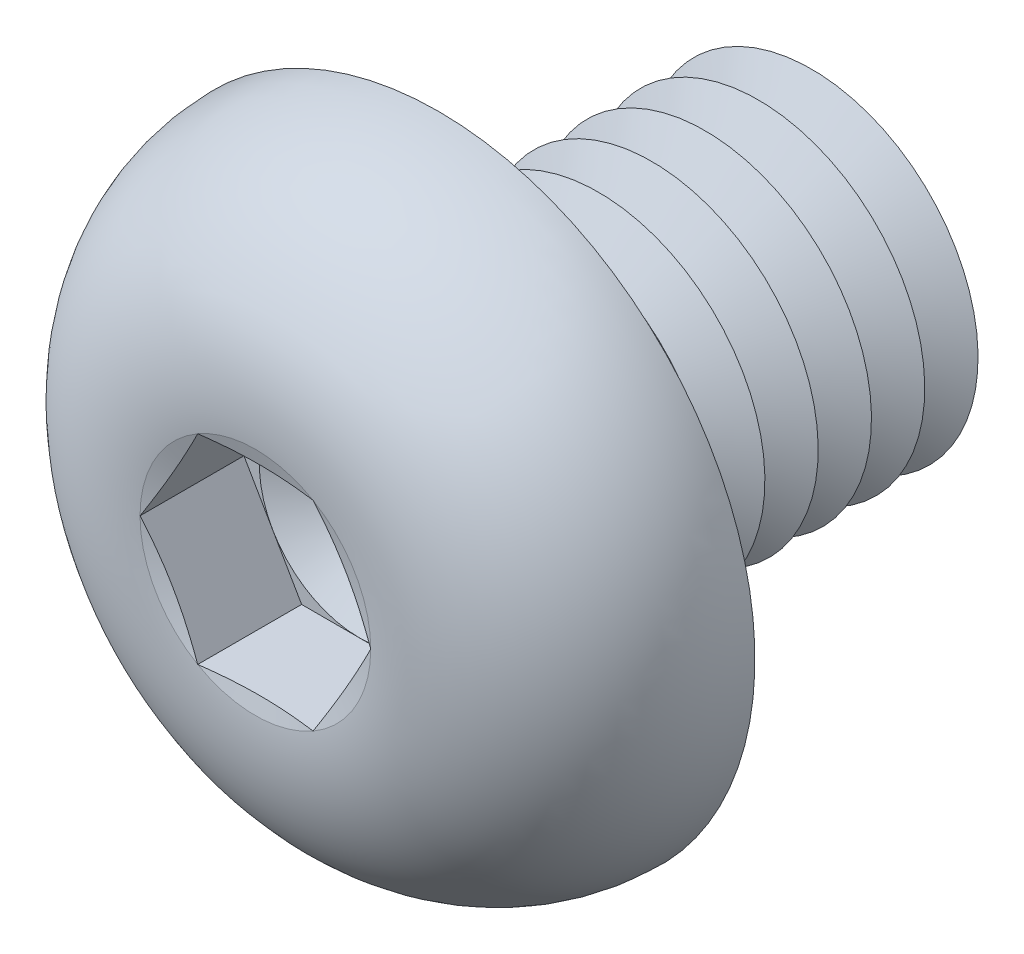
ISO-10303-21;
HEADER;
FILE_DESCRIPTION(('STEP AP214'),'2;1');
FILE_NAME('part.step','',(''),(''),'','','');
FILE_SCHEMA(('AUTOMOTIVE_DESIGN { 1 0 10303 214 1 1 1 1 }'));
ENDSEC;
DATA;
#1=APPLICATION_CONTEXT('core data for automotive mechanical design processes');
#2=APPLICATION_PROTOCOL_DEFINITION('international standard','automotive_design',2000,#1);
#3=PRODUCT_CONTEXT('',#1,'mechanical');
#4=PRODUCT('Part','Part','',(#3));
#5=PRODUCT_RELATED_PRODUCT_CATEGORY('part','',(#4));
#6=PRODUCT_DEFINITION_FORMATION('','',#4);
#7=PRODUCT_DEFINITION_CONTEXT('part definition',#1,'design');
#8=PRODUCT_DEFINITION('design','',#6,#7);
#9=PRODUCT_DEFINITION_SHAPE('','',#8);
#10=(LENGTH_UNIT() NAMED_UNIT(*) SI_UNIT(.MILLI.,.METRE.));
#11=(NAMED_UNIT(*) PLANE_ANGLE_UNIT() SI_UNIT($,.RADIAN.));
#12=(NAMED_UNIT(*) SI_UNIT($,.STERADIAN.) SOLID_ANGLE_UNIT());
#13=UNCERTAINTY_MEASURE_WITH_UNIT(LENGTH_MEASURE(1.E-05),#10,'distance_accuracy_value','');
#14=(GEOMETRIC_REPRESENTATION_CONTEXT(3) GLOBAL_UNCERTAINTY_ASSIGNED_CONTEXT((#13)) GLOBAL_UNIT_ASSIGNED_CONTEXT((#10,
#11,#12)) REPRESENTATION_CONTEXT('',''));
#15=CARTESIAN_POINT('',(0.,0.,0.));
#16=DIRECTION('',(0.,0.,1.));
#17=DIRECTION('',(1.,0.,0.));
#18=AXIS2_PLACEMENT_3D('',#15,#16,#17);
#19=CARTESIAN_POINT('',(0.,0.,1.19));
#20=DIRECTION('',(0.,0.,1.));
#21=DIRECTION('',(1.,0.,0.));
#22=AXIS2_PLACEMENT_3D('',#19,#20,#21);
#23=PLANE('',#22);
#24=CARTESIAN_POINT('',(0.,0.,1.19));
#25=DIRECTION('',(0.,0.,1.));
#26=DIRECTION('',(1.,0.,0.));
#27=AXIS2_PLACEMENT_3D('',#24,#25,#26);
#28=CIRCLE('',#27,1.49999930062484);
#29=CARTESIAN_POINT('',(1.2990375,0.749999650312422,1.19));
#30=VERTEX_POINT('',#29);
#31=CARTESIAN_POINT('',(0.,1.49999930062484,1.19));
#32=VERTEX_POINT('',#31);
#33=EDGE_CURVE('E118',#30,#32,#28,.T.);
#34=ORIENTED_EDGE('',*,*,#33,.F.);
#35=DIRECTION('',(-0.5,0.866025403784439,0.));
#36=VECTOR('',#35,1.);
#37=CARTESIAN_POINT('',(1.73205000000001,0.,1.19));
#38=LINE('',#37,#36);
#39=CARTESIAN_POINT('',(0.866025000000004,1.49999930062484,1.19));
#40=VERTEX_POINT('',#39);
#41=EDGE_CURVE('E125',#30,#40,#38,.T.);
#42=ORIENTED_EDGE('',*,*,#41,.T.);
#43=DIRECTION('',(-1.,0.,0.));
#44=VECTOR('',#43,1.);
#45=CARTESIAN_POINT('',(0.866025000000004,1.49999930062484,1.19));
#46=LINE('',#45,#44);
#47=EDGE_CURVE('E136',#40,#32,#46,.T.);
#48=ORIENTED_EDGE('',*,*,#47,.T.);
#49=EDGE_LOOP('',(#34,#42,#48));
#50=FACE_BOUND('',#49,.T.);
#51=ADVANCED_FACE('F39',(#50),#23,.T.);
#52=CARTESIAN_POINT('',(0.,0.,1.19));
#53=DIRECTION('',(0.,0.,1.));
#54=DIRECTION('',(1.,0.,0.));
#55=AXIS2_PLACEMENT_3D('',#52,#53,#54);
#56=CIRCLE('',#55,1.49999930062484);
#57=CARTESIAN_POINT('',(-1.2990375,0.749999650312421,1.19));
#58=VERTEX_POINT('',#57);
#59=EDGE_CURVE('E11',#32,#58,#56,.T.);
#60=ORIENTED_EDGE('',*,*,#59,.F.);
#61=CARTESIAN_POINT('',(-0.866025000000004,1.49999930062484,1.19));
#62=VERTEX_POINT('',#61);
#63=EDGE_CURVE('E131',#32,#62,#46,.T.);
#64=ORIENTED_EDGE('',*,*,#63,.T.);
#65=DIRECTION('',(-0.5,-0.866025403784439,0.));
#66=VECTOR('',#65,1.);
#67=CARTESIAN_POINT('',(-0.866025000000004,1.49999930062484,1.19));
#68=LINE('',#67,#66);
#69=EDGE_CURVE('E134',#62,#58,#68,.T.);
#70=ORIENTED_EDGE('',*,*,#69,.T.);
#71=EDGE_LOOP('',(#60,#64,#70));
#72=FACE_BOUND('',#71,.T.);
#73=ADVANCED_FACE('F130',(#72),#23,.T.);
#74=CARTESIAN_POINT('',(-1.2990375,-0.749999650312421,1.19));
#75=VERTEX_POINT('',#74);
#76=EDGE_CURVE('E49',#58,#75,#56,.T.);
#77=ORIENTED_EDGE('',*,*,#76,.F.);
#78=CARTESIAN_POINT('',(-1.73205000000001,0.,1.19));
#79=VERTEX_POINT('',#78);
#80=EDGE_CURVE('E143',#58,#79,#68,.T.);
#81=ORIENTED_EDGE('',*,*,#80,.T.);
#82=DIRECTION('',(0.5,-0.866025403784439,0.));
#83=VECTOR('',#82,1.);
#84=CARTESIAN_POINT('',(-1.73205000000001,0.,1.19));
#85=LINE('',#84,#83);
#86=EDGE_CURVE('E152',#79,#75,#85,.T.);
#87=ORIENTED_EDGE('',*,*,#86,.T.);
#88=EDGE_LOOP('',(#77,#81,#87));
#89=FACE_BOUND('',#88,.T.);
#90=ADVANCED_FACE('F327',(#89),#23,.T.);
#91=CARTESIAN_POINT('',(0.,-1.49999930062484,1.19));
#92=VERTEX_POINT('',#91);
#93=EDGE_CURVE('E311',#75,#92,#56,.T.);
#94=ORIENTED_EDGE('',*,*,#93,.F.);
#95=CARTESIAN_POINT('',(-0.866025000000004,-1.49999930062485,1.19));
#96=VERTEX_POINT('',#95);
#97=EDGE_CURVE('E151',#75,#96,#85,.T.);
#98=ORIENTED_EDGE('',*,*,#97,.T.);
#99=DIRECTION('',(1.,0.,0.));
#100=VECTOR('',#99,1.);
#101=CARTESIAN_POINT('',(-0.866025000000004,-1.49999930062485,1.19));
#102=LINE('',#101,#100);
#103=EDGE_CURVE('E157',#96,#92,#102,.T.);
#104=ORIENTED_EDGE('',*,*,#103,.T.);
#105=EDGE_LOOP('',(#94,#98,#104));
#106=FACE_BOUND('',#105,.T.);
#107=ADVANCED_FACE('F321',(#106),#23,.T.);
#108=CARTESIAN_POINT('',(1.29903750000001,-0.749999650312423,1.19));
#109=VERTEX_POINT('',#108);
#110=EDGE_CURVE('E56',#92,#109,#56,.T.);
#111=ORIENTED_EDGE('',*,*,#110,.F.);
#112=CARTESIAN_POINT('',(0.866025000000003,-1.49999930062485,1.19));
#113=VERTEX_POINT('',#112);
#114=EDGE_CURVE('E156',#92,#113,#102,.T.);
#115=ORIENTED_EDGE('',*,*,#114,.T.);
#116=DIRECTION('',(0.5,0.866025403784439,0.));
#117=VECTOR('',#116,1.);
#118=CARTESIAN_POINT('',(0.866025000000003,-1.49999930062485,1.19));
#119=LINE('',#118,#117);
#120=EDGE_CURVE('E162',#113,#109,#119,.T.);
#121=ORIENTED_EDGE('',*,*,#120,.T.);
#122=EDGE_LOOP('',(#111,#115,#121));
#123=FACE_BOUND('',#122,.T.);
#124=ADVANCED_FACE('F397',(#123),#23,.T.);
#125=CARTESIAN_POINT('',(0.,0.,2.75));
#126=DIRECTION('',(0.,0.,1.));
#127=DIRECTION('',(0.,-1.,0.));
#128=AXIS2_PLACEMENT_3D('',#125,#126,#127);
#129=CONICAL_SURFACE('',#128,1.73205000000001,1.30899693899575);
#130=CARTESIAN_POINT('',(1.73216547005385,-0.000200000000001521,2.75003094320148));
#131=CARTESIAN_POINT('',(1.69619207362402,0.06210775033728,2.74038633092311));
#132=CARTESIAN_POINT('',(1.66015343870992,0.124528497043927,2.73163050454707));
#133=CARTESIAN_POINT('',(1.58794885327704,0.249590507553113,2.71624720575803));
#134=CARTESIAN_POINT('',(1.55178285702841,0.312231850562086,2.70962059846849));
#135=CARTESIAN_POINT('',(1.47954289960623,0.437355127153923,2.69888271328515));
#136=CARTESIAN_POINT('',(1.4434694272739,0.499836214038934,2.69475862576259));
#137=CARTESIAN_POINT('',(1.37127646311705,0.624878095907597,2.68922863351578));
#138=CARTESIAN_POINT('',(1.33515698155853,0.687438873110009,2.68782220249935));
#139=CARTESIAN_POINT('',(1.26291801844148,0.812560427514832,2.68782220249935));
#140=CARTESIAN_POINT('',(1.22679853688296,0.875121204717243,2.68922863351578));
#141=CARTESIAN_POINT('',(1.15460557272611,1.00016308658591,2.69475862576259));
#142=CARTESIAN_POINT('',(1.11853210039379,1.06264417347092,2.69888271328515));
#143=CARTESIAN_POINT('',(1.0462921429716,1.18776745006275,2.70962059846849));
#144=CARTESIAN_POINT('',(1.01012614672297,1.25040879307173,2.71624720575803));
#145=CARTESIAN_POINT('',(0.937921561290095,1.37547080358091,2.73163050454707));
#146=CARTESIAN_POINT('',(0.901882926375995,1.43789155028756,2.74038633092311));
#147=CARTESIAN_POINT('',(0.865909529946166,1.50019930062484,2.75003094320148));
#148=B_SPLINE_CURVE_WITH_KNOTS('',3,(#130,#131,#132,#133,#134,#135,#136,#137,#138,#139,#140,
#141,#142,#143,#144,#145,#146,#147),.UNSPECIFIED.,.F.,.F.,(4,2,2,2,2,2,2,2,4),(0.,
0.217782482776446,0.435653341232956,0.652399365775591,0.869103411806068,1.08580745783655,
1.30255348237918,1.52042434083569,1.73820682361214),.UNSPECIFIED.);
#149=CARTESIAN_POINT('',(1.73205000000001,0.,2.75));
#150=VERTEX_POINT('',#149);
#151=CARTESIAN_POINT('',(0.866025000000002,1.49999930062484,2.75));
#152=VERTEX_POINT('',#151);
#153=EDGE_CURVE('E221',#150,#152,#148,.T.);
#154=ORIENTED_EDGE('',*,*,#153,.F.);
#155=CARTESIAN_POINT('',(0.,0.,2.75));
#156=DIRECTION('',(0.,0.,-1.));
#157=DIRECTION('',(0.,1.,0.));
#158=AXIS2_PLACEMENT_3D('',#155,#156,#157);
#159=CIRCLE('',#158,1.73205000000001);
#160=EDGE_CURVE('E293',#152,#150,#159,.T.);
#161=ORIENTED_EDGE('',*,*,#160,.F.);
#162=EDGE_LOOP('',(#154,#161));
#163=FACE_BOUND('',#162,.T.);
#164=ADVANCED_FACE('F401',(#163),#129,.F.);
#165=CARTESIAN_POINT('',(0.865909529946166,-1.50019930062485,2.75003094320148));
#166=CARTESIAN_POINT('',(0.901882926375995,-1.43789155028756,2.7403863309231));
#167=CARTESIAN_POINT('',(0.937921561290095,-1.37547080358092,2.73163050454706));
#168=CARTESIAN_POINT('',(1.01012614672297,-1.25040879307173,2.71624720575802));
#169=CARTESIAN_POINT('',(1.0462921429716,-1.18776745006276,2.70962059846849));
#170=CARTESIAN_POINT('',(1.11853210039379,-1.06264417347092,2.69888271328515));
#171=CARTESIAN_POINT('',(1.15460557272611,-1.00016308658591,2.69475862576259));
#172=CARTESIAN_POINT('',(1.22679853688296,-0.875121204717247,2.68922863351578));
#173=CARTESIAN_POINT('',(1.26291801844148,-0.812560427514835,2.68782220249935));
#174=CARTESIAN_POINT('',(1.33515698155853,-0.687438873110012,2.68782220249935));
#175=CARTESIAN_POINT('',(1.37127646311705,-0.6248780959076,2.68922863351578));
#176=CARTESIAN_POINT('',(1.4434694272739,-0.499836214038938,2.69475862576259));
#177=CARTESIAN_POINT('',(1.47954289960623,-0.437355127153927,2.69888271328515));
#178=CARTESIAN_POINT('',(1.55178285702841,-0.312231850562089,2.70962059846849));
#179=CARTESIAN_POINT('',(1.58794885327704,-0.249590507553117,2.71624720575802));
#180=CARTESIAN_POINT('',(1.66015343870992,-0.12452849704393,2.73163050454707));
#181=CARTESIAN_POINT('',(1.69619207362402,-0.0621077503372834,2.74038633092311));
#182=CARTESIAN_POINT('',(1.73216547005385,0.000199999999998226,2.75003094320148));
#183=B_SPLINE_CURVE_WITH_KNOTS('',3,(#165,#166,#167,#168,#169,#170,#171,#172,#173,#174,#175,
#176,#177,#178,#179,#180,#181,#182),.UNSPECIFIED.,.F.,.F.,(4,2,2,2,2,2,2,2,4),(0.,
0.217782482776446,0.435653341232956,0.65239936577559,0.869103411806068,1.08580745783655,
1.30255348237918,1.52042434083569,1.73820682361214),.UNSPECIFIED.);
#184=CARTESIAN_POINT('',(0.866025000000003,-1.49999930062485,2.75));
#185=VERTEX_POINT('',#184);
#186=EDGE_CURVE('E230',#185,#150,#183,.T.);
#187=ORIENTED_EDGE('',*,*,#186,.F.);
#188=EDGE_CURVE('E298',#150,#185,#159,.T.);
#189=ORIENTED_EDGE('',*,*,#188,.F.);
#190=EDGE_LOOP('',(#187,#189));
#191=FACE_BOUND('',#190,.T.);
#192=ADVANCED_FACE('F362',(#191),#129,.F.);
#193=CARTESIAN_POINT('',(-2.61375031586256,-1.49999930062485,3.09338600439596));
#194=CARTESIAN_POINT('',(-2.4871989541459,-1.49999930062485,3.06401688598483));
#195=CARTESIAN_POINT('',(-2.36054180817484,-1.49999930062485,3.03507426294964));
#196=CARTESIAN_POINT('',(-2.10688190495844,-1.49999930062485,2.97862489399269));
#197=CARTESIAN_POINT('',(-1.97987908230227,-1.49999930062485,2.95111844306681));
#198=CARTESIAN_POINT('',(-1.72425281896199,-1.49999930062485,2.89788845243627));
#199=CARTESIAN_POINT('',(-1.59562534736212,-1.49999930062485,2.87218404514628));
#200=CARTESIAN_POINT('',(-1.33776732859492,-1.49999930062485,2.82387586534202));
#201=CARTESIAN_POINT('',(-1.20853672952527,-1.49999930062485,2.80127236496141));
#202=CARTESIAN_POINT('',(-0.952831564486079,-1.49999930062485,2.76126658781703));
#203=CARTESIAN_POINT('',(-0.826376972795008,-1.49999930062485,2.74374018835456));
#204=CARTESIAN_POINT('',(-0.572755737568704,-1.49999930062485,2.71502809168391));
#205=CARTESIAN_POINT('',(-0.445589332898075,-1.49999930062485,2.70384038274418));
#206=CARTESIAN_POINT('',(-0.191333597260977,-1.49999930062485,2.68972083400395));
#207=CARTESIAN_POINT('',(-0.0642464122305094,-1.49999930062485,2.68675270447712));
#208=CARTESIAN_POINT('',(0.189835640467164,-1.49999930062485,2.68959577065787));
#209=CARTESIAN_POINT('',(0.316830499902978,-1.49999930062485,2.69540767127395));
#210=CARTESIAN_POINT('',(0.534182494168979,-1.49999930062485,2.71190493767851));
#211=CARTESIAN_POINT('',(0.624691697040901,-1.49999930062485,2.72073513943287));
#212=CARTESIAN_POINT('',(0.805336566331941,-1.49999930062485,2.74156379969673));
#213=CARTESIAN_POINT('',(0.895472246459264,-1.49999930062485,2.75356214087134));
#214=CARTESIAN_POINT('',(1.0756572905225,-1.49999930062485,2.78006977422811));
#215=CARTESIAN_POINT('',(1.16570548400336,-1.49999930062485,2.7945868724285));
#216=CARTESIAN_POINT('',(1.3454787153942,-1.49999930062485,2.82550612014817));
#217=CARTESIAN_POINT('',(1.43520373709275,-1.49999930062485,2.8419083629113));
#218=CARTESIAN_POINT('',(1.61622412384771,-1.49999930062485,2.87648604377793));
#219=CARTESIAN_POINT('',(1.7075137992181,-1.49999930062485,2.89469103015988));
#220=CARTESIAN_POINT('',(1.88986344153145,-1.49999930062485,2.93221618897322));
#221=CARTESIAN_POINT('',(1.9809234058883,-1.49999930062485,2.95153637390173));
#222=CARTESIAN_POINT('',(2.1623635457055,-1.49999930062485,2.99091506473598));
#223=CARTESIAN_POINT('',(2.25274472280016,-1.49999930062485,3.01096897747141));
#224=CARTESIAN_POINT('',(2.43335289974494,-1.49999930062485,3.05173139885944));
#225=CARTESIAN_POINT('',(2.52357990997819,-1.49999930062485,3.07243986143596));
#226=CARTESIAN_POINT('',(2.61375031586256,-1.49999930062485,3.09338600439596));
#227=B_SPLINE_CURVE_WITH_KNOTS('',3,(#193,#194,#195,#196,#197,#198,#199,#200,#201,#202,#203,
#204,#205,#206,#207,#208,#209,#210,#211,#212,#213,#214,#215,#216,#217,#218,#219,#220,#221,#222,
#223,#224,#225,#226),.UNSPECIFIED.,.F.,.F.,(4,2,2,2,2,2,2,2,2,2,2,2,2,2,2,2,4),(0.,
0.389753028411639,0.779585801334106,1.17307326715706,1.56659524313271,1.94947555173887,
2.33223427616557,2.71330039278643,3.09439710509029,3.36715350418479,3.63989980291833,
3.91350699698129,4.18712773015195,4.46638029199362,4.74563598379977,5.02337106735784,
5.30108664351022),.UNSPECIFIED.);
#228=CARTESIAN_POINT('',(-0.866025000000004,-1.49999930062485,2.75));
#229=VERTEX_POINT('',#228);
#230=EDGE_CURVE('E341',#229,#185,#227,.T.);
#231=ORIENTED_EDGE('',*,*,#230,.F.);
#232=EDGE_CURVE('E354',#185,#229,#159,.T.);
#233=ORIENTED_EDGE('',*,*,#232,.F.);
#234=EDGE_LOOP('',(#231,#233));
#235=FACE_BOUND('',#234,.T.);
#236=ADVANCED_FACE('F368',(#235),#129,.F.);
#237=CARTESIAN_POINT('',(-1.73216547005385,0.000199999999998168,2.75003094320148));
#238=CARTESIAN_POINT('',(-1.69619207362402,-0.0621077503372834,2.74038633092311));
#239=CARTESIAN_POINT('',(-1.66015343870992,-0.12452849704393,2.73163050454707));
#240=CARTESIAN_POINT('',(-1.58794885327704,-0.249590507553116,2.71624720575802));
#241=CARTESIAN_POINT('',(-1.55178285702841,-0.312231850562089,2.70962059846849));
#242=CARTESIAN_POINT('',(-1.47954289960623,-0.437355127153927,2.69888271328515));
#243=CARTESIAN_POINT('',(-1.4434694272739,-0.499836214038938,2.69475862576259));
#244=CARTESIAN_POINT('',(-1.37127646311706,-0.624878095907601,2.68922863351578));
#245=CARTESIAN_POINT('',(-1.33515698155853,-0.687438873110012,2.68782220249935));
#246=CARTESIAN_POINT('',(-1.26291801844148,-0.812560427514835,2.68782220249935));
#247=CARTESIAN_POINT('',(-1.22679853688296,-0.875121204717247,2.68922863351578));
#248=CARTESIAN_POINT('',(-1.15460557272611,-1.00016308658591,2.69475862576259));
#249=CARTESIAN_POINT('',(-1.11853210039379,-1.06264417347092,2.69888271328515));
#250=CARTESIAN_POINT('',(-1.0462921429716,-1.18776745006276,2.70962059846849));
#251=CARTESIAN_POINT('',(-1.01012614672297,-1.25040879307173,2.71624720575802));
#252=CARTESIAN_POINT('',(-0.937921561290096,-1.37547080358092,2.73163050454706));
#253=CARTESIAN_POINT('',(-0.901882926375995,-1.43789155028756,2.74038633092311));
#254=CARTESIAN_POINT('',(-0.865909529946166,-1.50019930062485,2.75003094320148));
#255=B_SPLINE_CURVE_WITH_KNOTS('',3,(#237,#238,#239,#240,#241,#242,#243,#244,#245,#246,#247,
#248,#249,#250,#251,#252,#253,#254),.UNSPECIFIED.,.F.,.F.,(4,2,2,2,2,2,2,2,4),(0.,
0.217782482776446,0.435653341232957,0.652399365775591,0.869103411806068,1.08580745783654,
1.30255348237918,1.52042434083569,1.73820682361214),.UNSPECIFIED.);
#256=CARTESIAN_POINT('',(-1.73205000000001,0.,2.75));
#257=VERTEX_POINT('',#256);
#258=EDGE_CURVE('E332',#257,#229,#255,.T.);
#259=ORIENTED_EDGE('',*,*,#258,.F.);
#260=EDGE_CURVE('E338',#229,#257,#159,.T.);
#261=ORIENTED_EDGE('',*,*,#260,.F.);
#262=EDGE_LOOP('',(#259,#261));
#263=FACE_BOUND('',#262,.T.);
#264=ADVANCED_FACE('F336',(#263),#129,.F.);
#265=CARTESIAN_POINT('',(-0.865909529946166,1.50019930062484,2.75003094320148));
#266=CARTESIAN_POINT('',(-0.901882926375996,1.43789155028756,2.74038633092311));
#267=CARTESIAN_POINT('',(-0.937921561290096,1.37547080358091,2.73163050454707));
#268=CARTESIAN_POINT('',(-1.01012614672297,1.25040879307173,2.71624720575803));
#269=CARTESIAN_POINT('',(-1.0462921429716,1.18776745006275,2.70962059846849));
#270=CARTESIAN_POINT('',(-1.11853210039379,1.06264417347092,2.69888271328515));
#271=CARTESIAN_POINT('',(-1.15460557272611,1.00016308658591,2.69475862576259));
#272=CARTESIAN_POINT('',(-1.22679853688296,0.875121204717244,2.68922863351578));
#273=CARTESIAN_POINT('',(-1.26291801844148,0.812560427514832,2.68782220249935));
#274=CARTESIAN_POINT('',(-1.33515698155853,0.687438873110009,2.68782220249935));
#275=CARTESIAN_POINT('',(-1.37127646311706,0.624878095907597,2.68922863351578));
#276=CARTESIAN_POINT('',(-1.4434694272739,0.499836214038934,2.69475862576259));
#277=CARTESIAN_POINT('',(-1.47954289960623,0.437355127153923,2.69888271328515));
#278=CARTESIAN_POINT('',(-1.55178285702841,0.312231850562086,2.70962059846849));
#279=CARTESIAN_POINT('',(-1.58794885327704,0.249590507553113,2.71624720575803));
#280=CARTESIAN_POINT('',(-1.66015343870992,0.124528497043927,2.73163050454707));
#281=CARTESIAN_POINT('',(-1.69619207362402,0.0621077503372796,2.74038633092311));
#282=CARTESIAN_POINT('',(-1.73216547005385,-0.000200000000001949,2.75003094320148));
#283=B_SPLINE_CURVE_WITH_KNOTS('',3,(#265,#266,#267,#268,#269,#270,#271,#272,#273,#274,#275,
#276,#277,#278,#279,#280,#281,#282),.UNSPECIFIED.,.F.,.F.,(4,2,2,2,2,2,2,2,4),(0.,
0.217782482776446,0.435653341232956,0.65239936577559,0.869103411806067,1.08580745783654,
1.30255348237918,1.52042434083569,1.73820682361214),.UNSPECIFIED.);
#284=CARTESIAN_POINT('',(-0.866025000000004,1.49999930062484,2.75));
#285=VERTEX_POINT('',#284);
#286=EDGE_CURVE('E194',#285,#257,#283,.T.);
#287=ORIENTED_EDGE('',*,*,#286,.F.);
#288=EDGE_CURVE('E344',#257,#285,#159,.T.);
#289=ORIENTED_EDGE('',*,*,#288,.F.);
#290=EDGE_LOOP('',(#287,#289));
#291=FACE_BOUND('',#290,.T.);
#292=ADVANCED_FACE('F345',(#291),#129,.F.);
#293=CARTESIAN_POINT('',(0.,0.,-3.2));
#294=DIRECTION('',(0.,0.,1.));
#295=DIRECTION('',(0.,-1.,0.));
#296=AXIS2_PLACEMENT_3D('',#293,#294,#295);
#297=CONICAL_SURFACE('',#296,2.49999999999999,1.0471975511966);
#298=CARTESIAN_POINT('',(0.,0.,-3.6));
#299=DIRECTION('',(0.,0.,1.));
#300=DIRECTION('',(0.,-1.,0.));
#301=AXIS2_PLACEMENT_3D('',#298,#299,#300);
#302=CIRCLE('',#301,1.80717967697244);
#303=CARTESIAN_POINT('',(0.,-1.80717967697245,-3.6));
#304=VERTEX_POINT('',#303);
#305=EDGE_CURVE('E264',#304,#304,#302,.T.);
#306=ORIENTED_EDGE('',*,*,#305,.T.);
#307=EDGE_LOOP('',(#306));
#308=FACE_BOUND('',#307,.T.);
#309=CARTESIAN_POINT('',(0.,0.,-3.2));
#310=DIRECTION('',(0.,0.,1.));
#311=DIRECTION('',(0.,-1.,0.));
#312=AXIS2_PLACEMENT_3D('',#309,#310,#311);
#313=CIRCLE('',#312,2.49999999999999);
#314=CARTESIAN_POINT('',(0.,-2.5,-3.20000000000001));
#315=VERTEX_POINT('',#314);
#316=EDGE_CURVE('E260',#315,#315,#313,.T.);
#317=ORIENTED_EDGE('',*,*,#316,.F.);
#318=EDGE_LOOP('',(#317));
#319=FACE_BOUND('',#318,.T.);
#320=ADVANCED_FACE('F429',(#308,#319),#297,.T.);
#321=CARTESIAN_POINT('',(0.,0.,-3.6));
#322=DIRECTION('',(0.,0.,-1.));
#323=DIRECTION('',(0.,1.,0.));
#324=AXIS2_PLACEMENT_3D('',#321,#322,#323);
#325=CONICAL_SURFACE('',#324,1.80717967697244,1.04719755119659);
#326=CARTESIAN_POINT('',(0.,0.,-4.));
#327=DIRECTION('',(0.,0.,1.));
#328=DIRECTION('',(0.,-1.,0.));
#329=AXIS2_PLACEMENT_3D('',#326,#327,#328);
#330=CIRCLE('',#329,2.49999999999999);
#331=CARTESIAN_POINT('',(0.,-2.5,-4.));
#332=VERTEX_POINT('',#331);
#333=EDGE_CURVE('E268',#332,#332,#330,.T.);
#334=ORIENTED_EDGE('',*,*,#333,.T.);
#335=EDGE_LOOP('',(#334));
#336=FACE_BOUND('',#335,.T.);
#337=ORIENTED_EDGE('',*,*,#305,.F.);
#338=EDGE_LOOP('',(#337));
#339=FACE_BOUND('',#338,.T.);
#340=ADVANCED_FACE('F434',(#336,#339),#325,.T.);
#341=CARTESIAN_POINT('',(0.,2.49999999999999,-6.));
#342=DIRECTION('',(0.,0.,-1.));
#343=DIRECTION('',(0.,1.,0.));
#344=AXIS2_PLACEMENT_3D('',#341,#342,#343);
#345=PLANE('',#344);
#346=CARTESIAN_POINT('',(0.,0.,-6.));
#347=DIRECTION('',(0.,0.,1.));
#348=DIRECTION('',(0.,-1.,0.));
#349=AXIS2_PLACEMENT_3D('',#346,#347,#348);
#350=CIRCLE('',#349,1.80717967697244);
#351=CARTESIAN_POINT('',(0.,-1.80717967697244,-6.));
#352=VERTEX_POINT('',#351);
#353=EDGE_CURVE('E288',#352,#352,#350,.T.);
#354=ORIENTED_EDGE('',*,*,#353,.F.);
#355=EDGE_LOOP('',(#354));
#356=FACE_BOUND('',#355,.T.);
#357=ADVANCED_FACE('F609',(#356),#345,.T.);
#358=CARTESIAN_POINT('',(0.,0.,-5.6));
#359=DIRECTION('',(0.,0.,1.));
#360=DIRECTION('',(0.,-1.,0.));
#361=AXIS2_PLACEMENT_3D('',#358,#359,#360);
#362=CONICAL_SURFACE('',#361,2.49999999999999,1.0471975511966);
#363=ORIENTED_EDGE('',*,*,#353,.T.);
#364=EDGE_LOOP('',(#363));
#365=FACE_BOUND('',#364,.T.);
#366=CARTESIAN_POINT('',(0.,0.,-5.6));
#367=DIRECTION('',(0.,0.,1.));
#368=DIRECTION('',(0.,-1.,0.));
#369=AXIS2_PLACEMENT_3D('',#366,#367,#368);
#370=CIRCLE('',#369,2.49999999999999);
#371=CARTESIAN_POINT('',(0.,-2.5,-5.6));
#372=VERTEX_POINT('',#371);
#373=EDGE_CURVE('E284',#372,#372,#370,.T.);
#374=ORIENTED_EDGE('',*,*,#373,.F.);
#375=EDGE_LOOP('',(#374));
#376=FACE_BOUND('',#375,.T.);
#377=ADVANCED_FACE('F602',(#365,#376),#362,.T.);
#378=CARTESIAN_POINT('',(0.,0.,-5.2));
#379=DIRECTION('',(0.,0.,-1.));
#380=DIRECTION('',(0.,1.,0.));
#381=AXIS2_PLACEMENT_3D('',#378,#379,#380);
#382=CONICAL_SURFACE('',#381,1.80717967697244,1.04719755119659);
#383=ORIENTED_EDGE('',*,*,#373,.T.);
#384=EDGE_LOOP('',(#383));
#385=FACE_BOUND('',#384,.T.);
#386=CARTESIAN_POINT('',(0.,0.,-5.2));
#387=DIRECTION('',(0.,0.,1.));
#388=DIRECTION('',(0.,-1.,0.));
#389=AXIS2_PLACEMENT_3D('',#386,#387,#388);
#390=CIRCLE('',#389,1.80717967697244);
#391=CARTESIAN_POINT('',(0.,-1.80717967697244,-5.2));
#392=VERTEX_POINT('',#391);
#393=EDGE_CURVE('E280',#392,#392,#390,.T.);
#394=ORIENTED_EDGE('',*,*,#393,.F.);
#395=EDGE_LOOP('',(#394));
#396=FACE_BOUND('',#395,.T.);
#397=ADVANCED_FACE('F608',(#385,#396),#382,.T.);
#398=CARTESIAN_POINT('',(0.,0.,-4.8));
#399=DIRECTION('',(0.,0.,1.));
#400=DIRECTION('',(0.,-1.,0.));
#401=AXIS2_PLACEMENT_3D('',#398,#399,#400);
#402=CONICAL_SURFACE('',#401,2.49999999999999,1.0471975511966);
#403=ORIENTED_EDGE('',*,*,#393,.T.);
#404=EDGE_LOOP('',(#403));
#405=FACE_BOUND('',#404,.T.);
#406=CARTESIAN_POINT('',(0.,0.,-4.8));
#407=DIRECTION('',(0.,0.,1.));
#408=DIRECTION('',(0.,-1.,0.));
#409=AXIS2_PLACEMENT_3D('',#406,#407,#408);
#410=CIRCLE('',#409,2.49999999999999);
#411=CARTESIAN_POINT('',(0.,-2.5,-4.80000000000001));
#412=VERTEX_POINT('',#411);
#413=EDGE_CURVE('E276',#412,#412,#410,.T.);
#414=ORIENTED_EDGE('',*,*,#413,.F.);
#415=EDGE_LOOP('',(#414));
#416=FACE_BOUND('',#415,.T.);
#417=ADVANCED_FACE('F640',(#405,#416),#402,.T.);
#418=CARTESIAN_POINT('',(0.,0.,-4.4));
#419=DIRECTION('',(0.,0.,-1.));
#420=DIRECTION('',(0.,1.,0.));
#421=AXIS2_PLACEMENT_3D('',#418,#419,#420);
#422=CONICAL_SURFACE('',#421,1.80717967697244,1.04719755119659);
#423=ORIENTED_EDGE('',*,*,#413,.T.);
#424=EDGE_LOOP('',(#423));
#425=FACE_BOUND('',#424,.T.);
#426=CARTESIAN_POINT('',(0.,0.,-4.4));
#427=DIRECTION('',(0.,0.,1.));
#428=DIRECTION('',(0.,-1.,0.));
#429=AXIS2_PLACEMENT_3D('',#426,#427,#428);
#430=CIRCLE('',#429,1.80717967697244);
#431=CARTESIAN_POINT('',(0.,-1.80717967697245,-4.4));
#432=VERTEX_POINT('',#431);
#433=EDGE_CURVE('E272',#432,#432,#430,.T.);
#434=ORIENTED_EDGE('',*,*,#433,.F.);
#435=EDGE_LOOP('',(#434));
#436=FACE_BOUND('',#435,.T.);
#437=ADVANCED_FACE('F650',(#425,#436),#422,.T.);
#438=CARTESIAN_POINT('',(0.,0.,-4.));
#439=DIRECTION('',(0.,0.,1.));
#440=DIRECTION('',(0.,-1.,0.));
#441=AXIS2_PLACEMENT_3D('',#438,#439,#440);
#442=CONICAL_SURFACE('',#441,2.49999999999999,1.0471975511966);
#443=ORIENTED_EDGE('',*,*,#433,.T.);
#444=EDGE_LOOP('',(#443));
#445=FACE_BOUND('',#444,.T.);
#446=ORIENTED_EDGE('',*,*,#333,.F.);
#447=EDGE_LOOP('',(#446));
#448=FACE_BOUND('',#447,.T.);
#449=ADVANCED_FACE('F660',(#445,#448),#442,.T.);
#450=CARTESIAN_POINT('',(0.,0.,-2.4));
#451=DIRECTION('',(0.,0.,1.));
#452=DIRECTION('',(0.,-1.,0.));
#453=AXIS2_PLACEMENT_3D('',#450,#451,#452);
#454=CONICAL_SURFACE('',#453,2.49999999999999,1.0471975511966);
#455=CARTESIAN_POINT('',(0.,0.,-2.8));
#456=DIRECTION('',(0.,0.,1.));
#457=DIRECTION('',(0.,-1.,0.));
#458=AXIS2_PLACEMENT_3D('',#455,#456,#457);
#459=CIRCLE('',#458,1.80717967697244);
#460=CARTESIAN_POINT('',(0.,-1.80717967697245,-2.8));
#461=VERTEX_POINT('',#460);
#462=EDGE_CURVE('E256',#461,#461,#459,.T.);
#463=ORIENTED_EDGE('',*,*,#462,.T.);
#464=EDGE_LOOP('',(#463));
#465=FACE_BOUND('',#464,.T.);
#466=CARTESIAN_POINT('',(0.,0.,-2.4));
#467=DIRECTION('',(0.,0.,1.));
#468=DIRECTION('',(0.,-1.,0.));
#469=AXIS2_PLACEMENT_3D('',#466,#467,#468);
#470=CIRCLE('',#469,2.49999999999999);
#471=CARTESIAN_POINT('',(0.,-2.5,-2.4));
#472=VERTEX_POINT('',#471);
#473=EDGE_CURVE('E252',#472,#472,#470,.T.);
#474=ORIENTED_EDGE('',*,*,#473,.F.);
#475=EDGE_LOOP('',(#474));
#476=FACE_BOUND('',#475,.T.);
#477=ADVANCED_FACE('F670',(#465,#476),#454,.T.);
#478=CARTESIAN_POINT('',(0.,0.,-2.8));
#479=DIRECTION('',(0.,0.,-1.));
#480=DIRECTION('',(0.,1.,0.));
#481=AXIS2_PLACEMENT_3D('',#478,#479,#480);
#482=CONICAL_SURFACE('',#481,1.80717967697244,1.04719755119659);
#483=ORIENTED_EDGE('',*,*,#316,.T.);
#484=EDGE_LOOP('',(#483));
#485=FACE_BOUND('',#484,.T.);
#486=ORIENTED_EDGE('',*,*,#462,.F.);
#487=EDGE_LOOP('',(#486));
#488=FACE_BOUND('',#487,.T.);
#489=ADVANCED_FACE('F680',(#485,#488),#482,.T.);
#490=CARTESIAN_POINT('',(0.,0.,-1.6));
#491=DIRECTION('',(0.,0.,1.));
#492=DIRECTION('',(0.,-1.,0.));
#493=AXIS2_PLACEMENT_3D('',#490,#491,#492);
#494=CONICAL_SURFACE('',#493,2.49999999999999,1.0471975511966);
#495=CARTESIAN_POINT('',(0.,0.,-2.));
#496=DIRECTION('',(0.,0.,1.));
#497=DIRECTION('',(0.,-1.,0.));
#498=AXIS2_PLACEMENT_3D('',#495,#496,#497);
#499=CIRCLE('',#498,1.80717967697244);
#500=CARTESIAN_POINT('',(0.,-1.80717967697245,-2.));
#501=VERTEX_POINT('',#500);
#502=EDGE_CURVE('E248',#501,#501,#499,.T.);
#503=ORIENTED_EDGE('',*,*,#502,.T.);
#504=EDGE_LOOP('',(#503));
#505=FACE_BOUND('',#504,.T.);
#506=CARTESIAN_POINT('',(0.,0.,-1.6));
#507=DIRECTION('',(0.,0.,1.));
#508=DIRECTION('',(0.,-1.,0.));
#509=AXIS2_PLACEMENT_3D('',#506,#507,#508);
#510=CIRCLE('',#509,2.49999999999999);
#511=CARTESIAN_POINT('',(0.,-2.5,-1.6));
#512=VERTEX_POINT('',#511);
#513=EDGE_CURVE('E240',#512,#512,#510,.T.);
#514=ORIENTED_EDGE('',*,*,#513,.F.);
#515=EDGE_LOOP('',(#514));
#516=FACE_BOUND('',#515,.T.);
#517=ADVANCED_FACE('F690',(#505,#516),#494,.T.);
#518=CARTESIAN_POINT('',(0.,0.,-2.));
#519=DIRECTION('',(0.,0.,-1.));
#520=DIRECTION('',(0.,1.,0.));
#521=AXIS2_PLACEMENT_3D('',#518,#519,#520);
#522=CONICAL_SURFACE('',#521,1.80717967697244,1.04719755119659);
#523=ORIENTED_EDGE('',*,*,#473,.T.);
#524=EDGE_LOOP('',(#523));
#525=FACE_BOUND('',#524,.T.);
#526=ORIENTED_EDGE('',*,*,#502,.F.);
#527=EDGE_LOOP('',(#526));
#528=FACE_BOUND('',#527,.T.);
#529=ADVANCED_FACE('F700',(#525,#528),#522,.T.);
#530=CARTESIAN_POINT('',(0.,0.,-0.800000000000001));
#531=DIRECTION('',(0.,0.,1.));
#532=DIRECTION('',(0.,-1.,0.));
#533=AXIS2_PLACEMENT_3D('',#530,#531,#532);
#534=CONICAL_SURFACE('',#533,2.49999999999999,1.0471975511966);
#535=CARTESIAN_POINT('',(0.,0.,-1.2));
#536=DIRECTION('',(0.,0.,1.));
#537=DIRECTION('',(0.,-1.,0.));
#538=AXIS2_PLACEMENT_3D('',#535,#536,#537);
#539=CIRCLE('',#538,1.80717967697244);
#540=CARTESIAN_POINT('',(0.,-1.80717967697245,-1.2));
#541=VERTEX_POINT('',#540);
#542=EDGE_CURVE('E229',#541,#541,#539,.T.);
#543=ORIENTED_EDGE('',*,*,#542,.T.);
#544=EDGE_LOOP('',(#543));
#545=FACE_BOUND('',#544,.T.);
#546=CARTESIAN_POINT('',(0.,0.,-0.800000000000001));
#547=DIRECTION('',(0.,0.,1.));
#548=DIRECTION('',(0.,-1.,0.));
#549=AXIS2_PLACEMENT_3D('',#546,#547,#548);
#550=CIRCLE('',#549,2.49999999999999);
#551=CARTESIAN_POINT('',(0.,-2.5,-0.800000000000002));
#552=VERTEX_POINT('',#551);
#553=EDGE_CURVE('E244',#552,#552,#550,.T.);
#554=ORIENTED_EDGE('',*,*,#553,.F.);
#555=EDGE_LOOP('',(#554));
#556=FACE_BOUND('',#555,.T.);
#557=ADVANCED_FACE('F426',(#545,#556),#534,.T.);
#558=CARTESIAN_POINT('',(0.,0.,-1.2));
#559=DIRECTION('',(0.,0.,-1.));
#560=DIRECTION('',(0.,1.,0.));
#561=AXIS2_PLACEMENT_3D('',#558,#559,#560);
#562=CONICAL_SURFACE('',#561,1.80717967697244,1.04719755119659);
#563=ORIENTED_EDGE('',*,*,#513,.T.);
#564=EDGE_LOOP('',(#563));
#565=FACE_BOUND('',#564,.T.);
#566=ORIENTED_EDGE('',*,*,#542,.F.);
#567=EDGE_LOOP('',(#566));
#568=FACE_BOUND('',#567,.T.);
#569=ADVANCED_FACE('F218',(#565,#568),#562,.T.);
#570=CARTESIAN_POINT('',(2.61375031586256,1.49999930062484,3.09338600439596));
#571=CARTESIAN_POINT('',(2.4871989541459,1.49999930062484,3.06401688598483));
#572=CARTESIAN_POINT('',(2.36054180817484,1.49999930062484,3.03507426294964));
#573=CARTESIAN_POINT('',(2.10688190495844,1.49999930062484,2.97862489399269));
#574=CARTESIAN_POINT('',(1.97987908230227,1.49999930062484,2.95111844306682));
#575=CARTESIAN_POINT('',(1.72425281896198,1.49999930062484,2.89788845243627));
#576=CARTESIAN_POINT('',(1.59562534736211,1.49999930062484,2.87218404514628));
#577=CARTESIAN_POINT('',(1.33776732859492,1.49999930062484,2.82387586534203));
#578=CARTESIAN_POINT('',(1.20853672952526,1.49999930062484,2.80127236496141));
#579=CARTESIAN_POINT('',(0.952831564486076,1.49999930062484,2.76126658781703));
#580=CARTESIAN_POINT('',(0.826376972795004,1.49999930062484,2.74374018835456));
#581=CARTESIAN_POINT('',(0.5727557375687,1.49999930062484,2.71502809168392));
#582=CARTESIAN_POINT('',(0.445589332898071,1.49999930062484,2.70384038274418));
#583=CARTESIAN_POINT('',(0.191333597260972,1.49999930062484,2.68972083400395));
#584=CARTESIAN_POINT('',(0.0642464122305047,1.49999930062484,2.68675270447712));
#585=CARTESIAN_POINT('',(-0.189835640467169,1.49999930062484,2.68959577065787));
#586=CARTESIAN_POINT('',(-0.316830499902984,1.49999930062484,2.69540767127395));
#587=CARTESIAN_POINT('',(-0.534182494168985,1.49999930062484,2.71190493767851));
#588=CARTESIAN_POINT('',(-0.624691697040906,1.49999930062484,2.72073513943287));
#589=CARTESIAN_POINT('',(-0.805336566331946,1.49999930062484,2.74156379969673));
#590=CARTESIAN_POINT('',(-0.895472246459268,1.49999930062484,2.75356214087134));
#591=CARTESIAN_POINT('',(-1.07565729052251,1.49999930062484,2.78006977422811));
#592=CARTESIAN_POINT('',(-1.16570548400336,1.49999930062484,2.7945868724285));
#593=CARTESIAN_POINT('',(-1.34547871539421,1.49999930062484,2.82550612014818));
#594=CARTESIAN_POINT('',(-1.43520373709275,1.49999930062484,2.8419083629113));
#595=CARTESIAN_POINT('',(-1.61622412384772,1.49999930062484,2.87648604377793));
#596=CARTESIAN_POINT('',(-1.7075137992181,1.49999930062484,2.89469103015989));
#597=CARTESIAN_POINT('',(-1.88986344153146,1.49999930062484,2.93221618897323));
#598=CARTESIAN_POINT('',(-1.9809234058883,1.49999930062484,2.95153637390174));
#599=CARTESIAN_POINT('',(-2.1623635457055,1.49999930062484,2.99091506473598));
#600=CARTESIAN_POINT('',(-2.25274472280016,1.49999930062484,3.01096897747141));
#601=CARTESIAN_POINT('',(-2.43335289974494,1.49999930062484,3.05173139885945));
#602=CARTESIAN_POINT('',(-2.52357990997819,1.49999930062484,3.07243986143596));
#603=CARTESIAN_POINT('',(-2.61375031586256,1.49999930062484,3.09338600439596));
#604=B_SPLINE_CURVE_WITH_KNOTS('',3,(#570,#571,#572,#573,#574,#575,#576,#577,#578,#579,#580,
#581,#582,#583,#584,#585,#586,#587,#588,#589,#590,#591,#592,#593,#594,#595,#596,#597,#598,#599,
#600,#601,#602,#603),.UNSPECIFIED.,.F.,.F.,(4,2,2,2,2,2,2,2,2,2,2,2,2,2,2,2,4),(0.,
0.389753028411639,0.779585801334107,1.17307326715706,1.56659524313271,1.94947555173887,
2.33223427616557,2.71330039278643,3.0943971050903,3.36715350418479,3.63989980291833,
3.91350699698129,4.18712773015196,4.46638029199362,4.74563598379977,5.02337106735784,
5.30108664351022),.UNSPECIFIED.);
#605=EDGE_CURVE('E170',#152,#285,#604,.T.);
#606=ORIENTED_EDGE('',*,*,#605,.F.);
#607=EDGE_CURVE('E292',#285,#152,#159,.T.);
#608=ORIENTED_EDGE('',*,*,#607,.F.);
#609=EDGE_LOOP('',(#606,#608));
#610=FACE_BOUND('',#609,.T.);
#611=ADVANCED_FACE('F201',(#610),#129,.F.);
#612=CARTESIAN_POINT('',(0.,0.,0.));
#613=DIRECTION('',(0.,0.,-1.));
#614=DIRECTION('',(0.,1.,0.));
#615=AXIS2_PLACEMENT_3D('',#612,#613,#614);
#616=DEGENERATE_TOROIDAL_SURFACE('',#615,1.98810497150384,2.76189502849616,.T.);
#617=ORIENTED_EDGE('',*,*,#160,.T.);
#618=ORIENTED_EDGE('',*,*,#188,.T.);
#619=ORIENTED_EDGE('',*,*,#232,.T.);
#620=ORIENTED_EDGE('',*,*,#260,.T.);
#621=ORIENTED_EDGE('',*,*,#288,.T.);
#622=ORIENTED_EDGE('',*,*,#607,.T.);
#623=EDGE_LOOP('',(#617,#618,#619,#620,#621,#622));
#624=FACE_BOUND('',#623,.T.);
#625=CARTESIAN_POINT('',(0.,0.,0.));
#626=DIRECTION('',(0.,0.,-1.));
#627=DIRECTION('',(0.,1.,0.));
#628=AXIS2_PLACEMENT_3D('',#625,#626,#627);
#629=CIRCLE('',#628,4.75);
#630=CARTESIAN_POINT('',(0.,4.74999999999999,0.));
#631=VERTEX_POINT('',#630);
#632=EDGE_CURVE('E297',#631,#631,#629,.T.);
#633=ORIENTED_EDGE('',*,*,#632,.F.);
#634=EDGE_LOOP('',(#633));
#635=FACE_BOUND('',#634,.T.);
#636=ADVANCED_FACE('F350',(#624,#635),#616,.T.);
#637=CARTESIAN_POINT('',(0.,2.49999999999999,0.));
#638=DIRECTION('',(0.,0.,-1.));
#639=DIRECTION('',(0.,1.,0.));
#640=AXIS2_PLACEMENT_3D('',#637,#638,#639);
#641=PLANE('',#640);
#642=CARTESIAN_POINT('',(0.,0.,0.));
#643=DIRECTION('',(0.,0.,-1.));
#644=DIRECTION('',(0.,1.,0.));
#645=AXIS2_PLACEMENT_3D('',#642,#643,#644);
#646=CIRCLE('',#645,2.89999999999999);
#647=CARTESIAN_POINT('',(0.,2.89999999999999,0.));
#648=VERTEX_POINT('',#647);
#649=EDGE_CURVE('E304',#648,#648,#646,.F.);
#650=ORIENTED_EDGE('',*,*,#649,.T.);
#651=EDGE_LOOP('',(#650));
#652=FACE_BOUND('',#651,.T.);
#653=ORIENTED_EDGE('',*,*,#632,.T.);
#654=EDGE_LOOP('',(#653));
#655=FACE_BOUND('',#654,.T.);
#656=ADVANCED_FACE('F425',(#652,#655),#641,.T.);
#657=CARTESIAN_POINT('',(0.,0.,-0.400000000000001));
#658=DIRECTION('',(0.,0.,-1.));
#659=DIRECTION('',(0.,1.,0.));
#660=AXIS2_PLACEMENT_3D('',#657,#658,#659);
#661=TOROIDAL_SURFACE('',#660,2.89999999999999,0.4);
#662=ORIENTED_EDGE('',*,*,#649,.F.);
#663=EDGE_LOOP('',(#662));
#664=FACE_BOUND('',#663,.T.);
#665=CARTESIAN_POINT('',(0.,0.,-0.400000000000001));
#666=DIRECTION('',(0.,0.,-1.));
#667=DIRECTION('',(0.,1.,0.));
#668=AXIS2_PLACEMENT_3D('',#665,#666,#667);
#669=CIRCLE('',#668,2.49999999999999);
#670=CARTESIAN_POINT('',(0.,2.49999999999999,-0.4));
#671=VERTEX_POINT('',#670);
#672=EDGE_CURVE('E301',#671,#671,#669,.T.);
#673=ORIENTED_EDGE('',*,*,#672,.F.);
#674=EDGE_LOOP('',(#673));
#675=FACE_BOUND('',#674,.T.);
#676=ADVANCED_FACE('F41',(#664,#675),#661,.F.);
#677=CARTESIAN_POINT('',(0.,0.,-6.));
#678=DIRECTION('',(0.,0.,-1.));
#679=DIRECTION('',(0.,1.,0.));
#680=AXIS2_PLACEMENT_3D('',#677,#678,#679);
#681=CYLINDRICAL_SURFACE('',#680,2.49999999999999);
#682=ORIENTED_EDGE('',*,*,#672,.T.);
#683=EDGE_LOOP('',(#682));
#684=FACE_BOUND('',#683,.T.);
#685=ORIENTED_EDGE('',*,*,#553,.T.);
#686=EDGE_LOOP('',(#685));
#687=FACE_BOUND('',#686,.T.);
#688=ADVANCED_FACE('F216',(#684,#687),#681,.T.);
#689=CARTESIAN_POINT('',(1.73205000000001,0.,1.19));
#690=DIRECTION('',(0.866025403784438,0.5,0.));
#691=DIRECTION('',(-0.5,0.866025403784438,0.));
#692=AXIS2_PLACEMENT_3D('',#689,#690,#691);
#693=PLANE('',#692);
#694=ORIENTED_EDGE('',*,*,#153,.T.);
#695=DIRECTION('',(0.,0.,1.));
#696=VECTOR('',#695,1.);
#697=CARTESIAN_POINT('',(0.866025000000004,1.49999930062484,1.19));
#698=LINE('',#697,#696);
#699=EDGE_CURVE('E64',#40,#152,#698,.T.);
#700=ORIENTED_EDGE('',*,*,#699,.F.);
#701=ORIENTED_EDGE('',*,*,#41,.F.);
#702=CARTESIAN_POINT('',(1.73205000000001,0.,1.19));
#703=VERTEX_POINT('',#702);
#704=EDGE_CURVE('E140',#703,#30,#38,.T.);
#705=ORIENTED_EDGE('',*,*,#704,.F.);
#706=DIRECTION('',(0.,0.,1.));
#707=VECTOR('',#706,1.);
#708=CARTESIAN_POINT('',(1.73205000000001,0.,1.19));
#709=LINE('',#708,#707);
#710=EDGE_CURVE('E166',#703,#150,#709,.T.);
#711=ORIENTED_EDGE('',*,*,#710,.T.);
#712=EDGE_LOOP('',(#694,#700,#701,#705,#711));
#713=FACE_BOUND('',#712,.T.);
#714=ADVANCED_FACE('F211',(#713),#693,.F.);
#715=CARTESIAN_POINT('',(0.866025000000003,-1.49999930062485,1.19));
#716=DIRECTION('',(0.866025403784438,-0.5,0.));
#717=DIRECTION('',(0.5,0.866025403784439,0.));
#718=AXIS2_PLACEMENT_3D('',#715,#716,#717);
#719=PLANE('',#718);
#720=ORIENTED_EDGE('',*,*,#186,.T.);
#721=ORIENTED_EDGE('',*,*,#710,.F.);
#722=EDGE_CURVE('E161',#109,#703,#119,.T.);
#723=ORIENTED_EDGE('',*,*,#722,.F.);
#724=ORIENTED_EDGE('',*,*,#120,.F.);
#725=DIRECTION('',(0.,0.,1.));
#726=VECTOR('',#725,1.);
#727=CARTESIAN_POINT('',(0.866025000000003,-1.49999930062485,1.19));
#728=LINE('',#727,#726);
#729=EDGE_CURVE('E171',#113,#185,#728,.T.);
#730=ORIENTED_EDGE('',*,*,#729,.T.);
#731=EDGE_LOOP('',(#720,#721,#723,#724,#730));
#732=FACE_BOUND('',#731,.T.);
#733=ADVANCED_FACE('F215',(#732),#719,.F.);
#734=CARTESIAN_POINT('',(-0.866025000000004,-1.49999930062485,1.19));
#735=DIRECTION('',(0.,-1.,0.));
#736=DIRECTION('',(1.,0.,0.));
#737=AXIS2_PLACEMENT_3D('',#734,#735,#736);
#738=PLANE('',#737);
#739=ORIENTED_EDGE('',*,*,#230,.T.);
#740=ORIENTED_EDGE('',*,*,#729,.F.);
#741=ORIENTED_EDGE('',*,*,#114,.F.);
#742=ORIENTED_EDGE('',*,*,#103,.F.);
#743=DIRECTION('',(0.,0.,1.));
#744=VECTOR('',#743,1.);
#745=CARTESIAN_POINT('',(-0.866025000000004,-1.49999930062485,1.19));
#746=LINE('',#745,#744);
#747=EDGE_CURVE('E175',#96,#229,#746,.T.);
#748=ORIENTED_EDGE('',*,*,#747,.T.);
#749=EDGE_LOOP('',(#739,#740,#741,#742,#748));
#750=FACE_BOUND('',#749,.T.);
#751=ADVANCED_FACE('F381',(#750),#738,.F.);
#752=CARTESIAN_POINT('',(-1.73205000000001,0.,1.19));
#753=DIRECTION('',(-0.866025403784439,-0.5,0.));
#754=DIRECTION('',(0.5,-0.866025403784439,0.));
#755=AXIS2_PLACEMENT_3D('',#752,#753,#754);
#756=PLANE('',#755);
#757=ORIENTED_EDGE('',*,*,#258,.T.);
#758=ORIENTED_EDGE('',*,*,#747,.F.);
#759=ORIENTED_EDGE('',*,*,#97,.F.);
#760=ORIENTED_EDGE('',*,*,#86,.F.);
#761=DIRECTION('',(0.,0.,1.));
#762=VECTOR('',#761,1.);
#763=CARTESIAN_POINT('',(-1.73205000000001,0.,1.19));
#764=LINE('',#763,#762);
#765=EDGE_CURVE('E179',#79,#257,#764,.T.);
#766=ORIENTED_EDGE('',*,*,#765,.T.);
#767=EDGE_LOOP('',(#757,#758,#759,#760,#766));
#768=FACE_BOUND('',#767,.T.);
#769=ADVANCED_FACE('F326',(#768),#756,.F.);
#770=CARTESIAN_POINT('',(-0.866025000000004,1.49999930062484,1.19));
#771=DIRECTION('',(-0.866025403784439,0.5,0.));
#772=DIRECTION('',(-0.5,-0.866025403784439,0.));
#773=AXIS2_PLACEMENT_3D('',#770,#771,#772);
#774=PLANE('',#773);
#775=ORIENTED_EDGE('',*,*,#286,.T.);
#776=ORIENTED_EDGE('',*,*,#765,.F.);
#777=ORIENTED_EDGE('',*,*,#80,.F.);
#778=ORIENTED_EDGE('',*,*,#69,.F.);
#779=DIRECTION('',(0.,0.,1.));
#780=VECTOR('',#779,1.);
#781=CARTESIAN_POINT('',(-0.866025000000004,1.49999930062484,1.19));
#782=LINE('',#781,#780);
#783=EDGE_CURVE('E138',#62,#285,#782,.T.);
#784=ORIENTED_EDGE('',*,*,#783,.T.);
#785=EDGE_LOOP('',(#775,#776,#777,#778,#784));
#786=FACE_BOUND('',#785,.T.);
#787=ADVANCED_FACE('F208',(#786),#774,.F.);
#788=CARTESIAN_POINT('',(0.866025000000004,1.49999930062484,1.19));
#789=DIRECTION('',(0.,1.,0.));
#790=DIRECTION('',(0.,0.,1.));
#791=AXIS2_PLACEMENT_3D('',#788,#789,#790);
#792=PLANE('',#791);
#793=ORIENTED_EDGE('',*,*,#605,.T.);
#794=ORIENTED_EDGE('',*,*,#783,.F.);
#795=ORIENTED_EDGE('',*,*,#63,.F.);
#796=ORIENTED_EDGE('',*,*,#47,.F.);
#797=ORIENTED_EDGE('',*,*,#699,.T.);
#798=EDGE_LOOP('',(#793,#794,#795,#796,#797));
#799=FACE_BOUND('',#798,.T.);
#800=ADVANCED_FACE('F135',(#799),#792,.F.);
#801=EDGE_CURVE('E43',#109,#30,#56,.T.);
#802=ORIENTED_EDGE('',*,*,#801,.F.);
#803=ORIENTED_EDGE('',*,*,#722,.T.);
#804=ORIENTED_EDGE('',*,*,#704,.T.);
#805=EDGE_LOOP('',(#802,#803,#804));
#806=FACE_BOUND('',#805,.T.);
#807=ADVANCED_FACE('F115',(#806),#23,.T.);
#808=CARTESIAN_POINT('',(0.,0.,1.19));
#809=DIRECTION('',(0.,0.,1.));
#810=DIRECTION('',(1.,0.,0.));
#811=AXIS2_PLACEMENT_3D('',#808,#809,#810);
#812=CONICAL_SURFACE('',#811,1.49999930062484,1.0471975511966);
#813=CARTESIAN_POINT('',(0.,0.,0.323975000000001));
#814=VERTEX_POINT('',#813);
#815=VERTEX_LOOP('',#814);
#816=FACE_BOUND('',#815,.T.);
#817=ORIENTED_EDGE('',*,*,#33,.T.);
#818=ORIENTED_EDGE('',*,*,#59,.T.);
#819=ORIENTED_EDGE('',*,*,#76,.T.);
#820=ORIENTED_EDGE('',*,*,#93,.T.);
#821=ORIENTED_EDGE('',*,*,#110,.T.);
#822=ORIENTED_EDGE('',*,*,#801,.T.);
#823=EDGE_LOOP('',(#817,#818,#819,#820,#821,#822));
#824=FACE_BOUND('',#823,.T.);
#825=ADVANCED_FACE('F113',(#816,#824),#812,.F.);
#826=CLOSED_SHELL('',(#51,#73,#90,#107,#124,#164,#192,#236,#264,#292,#320,#340,#357,#377,#397,
#417,#437,#449,#477,#489,#517,#529,#557,#569,#611,#636,#656,#676,#688,#714,#733,#751,#769,#787,
#800,#807,#825));
#827=MANIFOLD_SOLID_BREP('B2',#826);
#828=ADVANCED_BREP_SHAPE_REPRESENTATION('',(#18,#827),#14);
#829=SHAPE_DEFINITION_REPRESENTATION(#9,#828);
ENDSEC;
END-ISO-10303-21;
